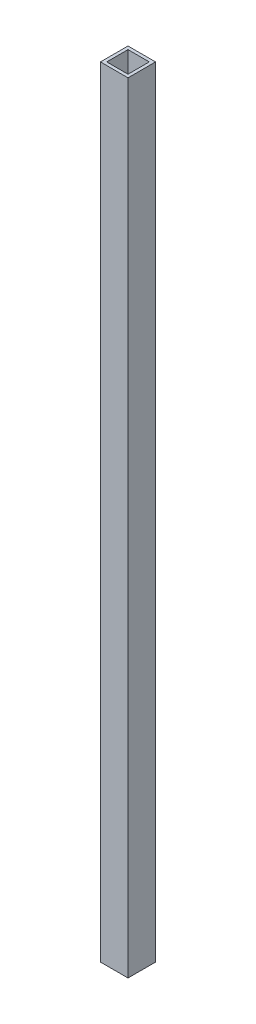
from build123d import *

# Parameters (mm, degrees)
SKETCH1_W                 = 26.5
SKETCH1_H                 = 26.5
SKETCH1_W_2               = 20.5
SKETCH1_H_2               = 20.5
BOSS_EXTRUDE1_DEPTH       = 750
F_6_CLEARANCE_HOLE2_D     = 3.7973
F_6_CLEARANCE_HOLE2_DEPTH = 5
F_6_CLEARANCE_HOLE2_TIP   = 1.140824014


with BuildPart() as part:
    # Sketch1 → Boss-Extrude1 (new body)
    with BuildSketch(Plane(origin=(0, 0, 0), x_dir=(1, 0, 0), z_dir=(0, 1, 0))):
        Rectangle(SKETCH1_W, SKETCH1_H)
        Rectangle(SKETCH1_W_2, SKETCH1_H_2, mode=Mode.SUBTRACT)
    extrude(amount=BOSS_EXTRUDE1_DEPTH)

    # 6 Clearance Hole2
    with Locations(Plane(origin=(0, 0, -13.25), x_dir=(-1, 0, 0), z_dir=(0, 0, -1))):
        with Locations((0, 40), (0, 90)):
            Hole(F_6_CLEARANCE_HOLE2_D / 2, depth=F_6_CLEARANCE_HOLE2_DEPTH)
            with Locations((0, 0, -(F_6_CLEARANCE_HOLE2_DEPTH + F_6_CLEARANCE_HOLE2_TIP / 2))):  # 118° drill point
                Cone(0, F_6_CLEARANCE_HOLE2_D / 2, F_6_CLEARANCE_HOLE2_TIP, mode=Mode.SUBTRACT)


solid = part.part
